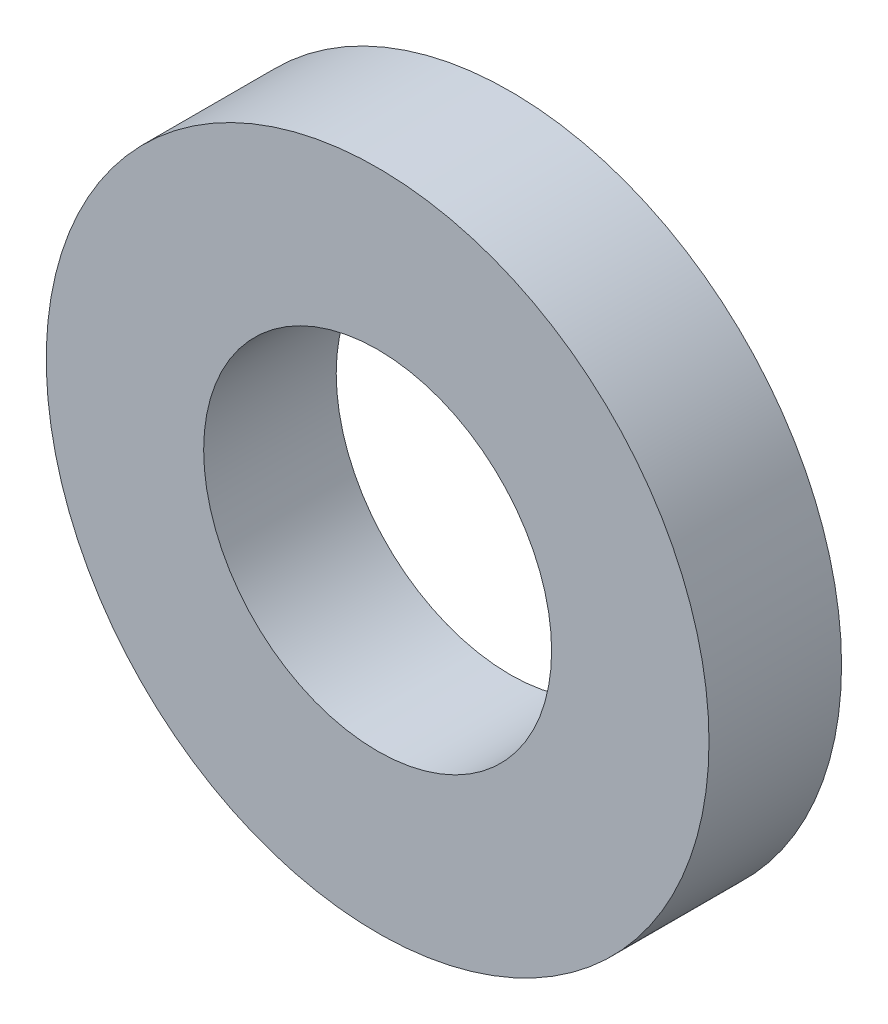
from build123d import *

# Parameters (mm, degrees)
ESQUISSE1_R        = 40
ESQUISSE1_R_2      = 21
BOSS_EXTRU_1_DEPTH = 16


with BuildPart() as part:
    # Esquisse1 → Boss.-Extru.1 (new body)
    with BuildSketch(Plane.XY):
        with Locations((350.941170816, 0)):
            Circle(ESQUISSE1_R)
        with Locations((350.941170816, 0)):
            Circle(ESQUISSE1_R_2, mode=Mode.SUBTRACT)
    extrude(amount=BOSS_EXTRU_1_DEPTH)


solid = part.part
